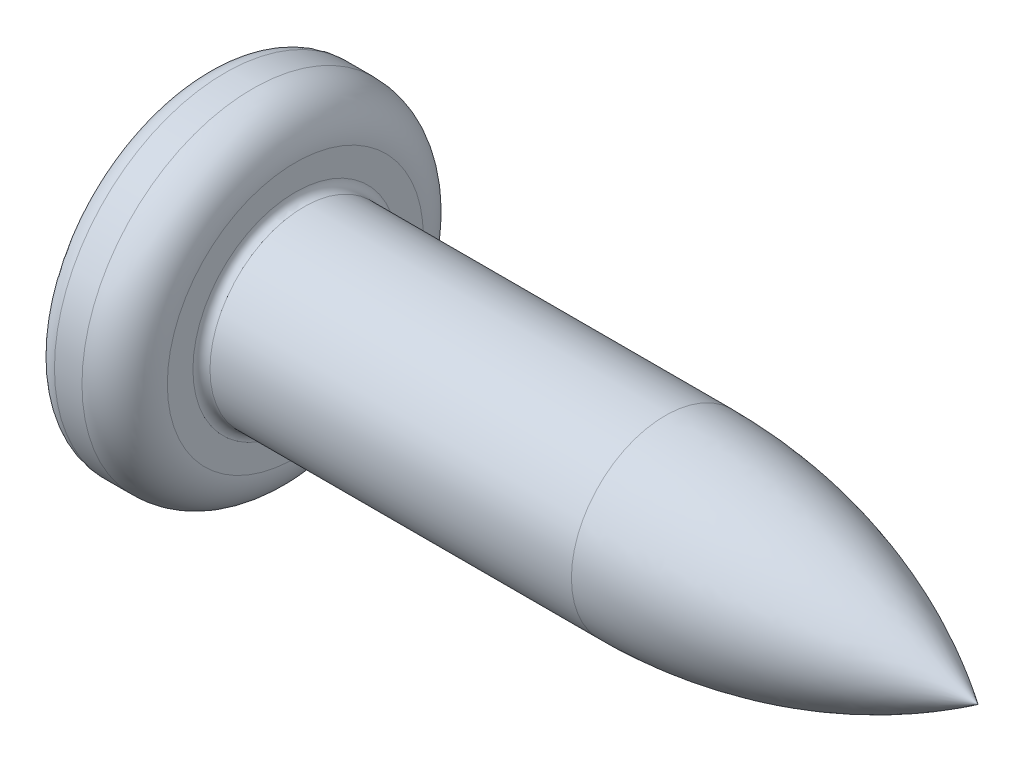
ISO-10303-21;
HEADER;
FILE_DESCRIPTION(('STEP AP214'),'2;1');
FILE_NAME('part.step','',(''),(''),'','','');
FILE_SCHEMA(('AUTOMOTIVE_DESIGN { 1 0 10303 214 1 1 1 1 }'));
ENDSEC;
DATA;
#1=APPLICATION_CONTEXT('core data for automotive mechanical design processes');
#2=APPLICATION_PROTOCOL_DEFINITION('international standard','automotive_design',2000,#1);
#3=PRODUCT_CONTEXT('',#1,'mechanical');
#4=PRODUCT('Part','Part','',(#3));
#5=PRODUCT_RELATED_PRODUCT_CATEGORY('part','',(#4));
#6=PRODUCT_DEFINITION_FORMATION('','',#4);
#7=PRODUCT_DEFINITION_CONTEXT('part definition',#1,'design');
#8=PRODUCT_DEFINITION('design','',#6,#7);
#9=PRODUCT_DEFINITION_SHAPE('','',#8);
#10=(LENGTH_UNIT() NAMED_UNIT(*) SI_UNIT(.MILLI.,.METRE.));
#11=(NAMED_UNIT(*) PLANE_ANGLE_UNIT() SI_UNIT($,.RADIAN.));
#12=(NAMED_UNIT(*) SI_UNIT($,.STERADIAN.) SOLID_ANGLE_UNIT());
#13=UNCERTAINTY_MEASURE_WITH_UNIT(LENGTH_MEASURE(1.E-05),#10,'distance_accuracy_value','');
#14=(GEOMETRIC_REPRESENTATION_CONTEXT(3) GLOBAL_UNCERTAINTY_ASSIGNED_CONTEXT((#13)) GLOBAL_UNIT_ASSIGNED_CONTEXT((#10,
#11,#12)) REPRESENTATION_CONTEXT('',''));
#15=CARTESIAN_POINT('',(0.,0.,0.));
#16=DIRECTION('',(0.,0.,1.));
#17=DIRECTION('',(1.,0.,0.));
#18=AXIS2_PLACEMENT_3D('',#15,#16,#17);
#19=CARTESIAN_POINT('',(4.,0.,0.));
#20=DIRECTION('',(-1.,0.,0.));
#21=DIRECTION('',(0.,1.,0.));
#22=AXIS2_PLACEMENT_3D('',#19,#20,#21);
#23=SPHERICAL_SURFACE('',#22,4.);
#24=CARTESIAN_POINT('',(0.465266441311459,0.,0.));
#25=DIRECTION('',(-1.,0.,0.));
#26=DIRECTION('',(0.,0.,1.));
#27=AXIS2_PLACEMENT_3D('',#24,#25,#26);
#28=CIRCLE('',#27,1.87234042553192);
#29=CARTESIAN_POINT('',(0.465266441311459,0.,1.87234042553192));
#30=VERTEX_POINT('',#29);
#31=EDGE_CURVE('E321',#30,#30,#28,.T.);
#32=ORIENTED_EDGE('',*,*,#31,.T.);
#33=EDGE_LOOP('',(#32));
#34=FACE_BOUND('',#33,.T.);
#35=CARTESIAN_POINT('',(0.0543400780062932,0.,0.));
#36=DIRECTION('',(1.,0.,0.));
#37=DIRECTION('',(0.,0.,-1.));
#38=AXIS2_PLACEMENT_3D('',#35,#36,#37);
#39=CIRCLE('',#38,0.657090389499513);
#40=CARTESIAN_POINT('',(0.0543400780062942,-0.369999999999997,-0.543017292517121));
#41=VERTEX_POINT('',#40);
#42=CARTESIAN_POINT('',(0.0543400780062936,-0.543017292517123,-0.37));
#43=VERTEX_POINT('',#42);
#44=EDGE_CURVE('E457',#41,#43,#39,.F.);
#45=ORIENTED_EDGE('',*,*,#44,.F.);
#46=CARTESIAN_POINT('',(4.,-0.37,0.));
#47=DIRECTION('',(0.,1.,0.));
#48=DIRECTION('',(0.,0.,1.));
#49=AXIS2_PLACEMENT_3D('',#46,#47,#48);
#50=CIRCLE('',#49,3.98285073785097);
#51=CARTESIAN_POINT('',(0.201999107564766,-0.369999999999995,-1.19928696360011));
#52=VERTEX_POINT('',#51);
#53=EDGE_CURVE('E283',#52,#41,#50,.T.);
#54=ORIENTED_EDGE('',*,*,#53,.F.);
#55=CARTESIAN_POINT('',(3.72274316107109,0.,0.556091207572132));
#56=DIRECTION('',(0.446197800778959,0.,-0.89493436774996));
#57=DIRECTION('',(-0.89493436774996,0.,-0.446197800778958));
#58=AXIS2_PLACEMENT_3D('',#55,#56,#57);
#59=CIRCLE('',#58,3.95144166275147);
#60=CARTESIAN_POINT('',(0.201999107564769,0.370000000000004,-1.19928696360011));
#61=VERTEX_POINT('',#60);
#62=EDGE_CURVE('E255',#52,#61,#59,.T.);
#63=ORIENTED_EDGE('',*,*,#62,.T.);
#64=CARTESIAN_POINT('',(4.,0.37,0.));
#65=DIRECTION('',(0.,-1.,0.));
#66=DIRECTION('',(0.,0.,-1.));
#67=AXIS2_PLACEMENT_3D('',#64,#65,#66);
#68=CIRCLE('',#67,3.98285073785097);
#69=CARTESIAN_POINT('',(0.0543400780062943,0.370000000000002,-0.543017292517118));
#70=VERTEX_POINT('',#69);
#71=EDGE_CURVE('E291',#70,#61,#68,.T.);
#72=ORIENTED_EDGE('',*,*,#71,.F.);
#73=CARTESIAN_POINT('',(0.0543400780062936,0.543017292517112,-0.37));
#74=VERTEX_POINT('',#73);
#75=EDGE_CURVE('E370',#74,#70,#39,.F.);
#76=ORIENTED_EDGE('',*,*,#75,.F.);
#77=CARTESIAN_POINT('',(4.,0.,-0.37));
#78=DIRECTION('',(0.,0.,1.));
#79=DIRECTION('',(0.,-1.,0.));
#80=AXIS2_PLACEMENT_3D('',#77,#78,#79);
#81=CIRCLE('',#80,3.98285073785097);
#82=CARTESIAN_POINT('',(0.201999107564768,1.19928696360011,-0.37));
#83=VERTEX_POINT('',#82);
#84=EDGE_CURVE('E249',#83,#74,#81,.T.);
#85=ORIENTED_EDGE('',*,*,#84,.F.);
#86=CARTESIAN_POINT('',(3.72274316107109,-0.556091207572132,0.));
#87=DIRECTION('',(0.446197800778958,0.89493436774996,0.));
#88=DIRECTION('',(-0.89493436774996,0.446197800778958,0.));
#89=AXIS2_PLACEMENT_3D('',#86,#87,#88);
#90=CIRCLE('',#89,3.95144166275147);
#91=CARTESIAN_POINT('',(0.201999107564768,1.19928696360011,0.369999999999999));
#92=VERTEX_POINT('',#91);
#93=EDGE_CURVE('E252',#83,#92,#90,.T.);
#94=ORIENTED_EDGE('',*,*,#93,.T.);
#95=CARTESIAN_POINT('',(4.,0.,0.37));
#96=DIRECTION('',(0.,0.,-1.));
#97=DIRECTION('',(0.,1.,0.));
#98=AXIS2_PLACEMENT_3D('',#95,#96,#97);
#99=CIRCLE('',#98,3.98285073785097);
#100=CARTESIAN_POINT('',(0.0543400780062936,0.543017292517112,0.37));
#101=VERTEX_POINT('',#100);
#102=EDGE_CURVE('E245',#101,#92,#99,.T.);
#103=ORIENTED_EDGE('',*,*,#102,.F.);
#104=CARTESIAN_POINT('',(0.054340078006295,0.369999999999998,0.54301729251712));
#105=VERTEX_POINT('',#104);
#106=EDGE_CURVE('E403',#105,#101,#39,.F.);
#107=ORIENTED_EDGE('',*,*,#106,.F.);
#108=CARTESIAN_POINT('',(0.201999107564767,0.369999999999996,1.19928696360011));
#109=VERTEX_POINT('',#108);
#110=EDGE_CURVE('E265',#109,#105,#68,.T.);
#111=ORIENTED_EDGE('',*,*,#110,.F.);
#112=CARTESIAN_POINT('',(3.72274316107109,0.,-0.556091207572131));
#113=DIRECTION('',(0.446197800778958,0.,0.89493436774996));
#114=DIRECTION('',(0.89493436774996,0.,-0.446197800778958));
#115=AXIS2_PLACEMENT_3D('',#112,#113,#114);
#116=CIRCLE('',#115,3.95144166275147);
#117=CARTESIAN_POINT('',(0.201999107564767,-0.370000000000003,1.19928696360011));
#118=VERTEX_POINT('',#117);
#119=EDGE_CURVE('E40',#109,#118,#116,.T.);
#120=ORIENTED_EDGE('',*,*,#119,.T.);
#121=CARTESIAN_POINT('',(0.0543400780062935,-0.370000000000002,0.543017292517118));
#122=VERTEX_POINT('',#121);
#123=EDGE_CURVE('E262',#122,#118,#50,.T.);
#124=ORIENTED_EDGE('',*,*,#123,.F.);
#125=CARTESIAN_POINT('',(0.0543400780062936,-0.543017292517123,0.369999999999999));
#126=VERTEX_POINT('',#125);
#127=EDGE_CURVE('E442',#126,#122,#39,.F.);
#128=ORIENTED_EDGE('',*,*,#127,.F.);
#129=CARTESIAN_POINT('',(0.201999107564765,-1.19928696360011,0.369999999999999));
#130=VERTEX_POINT('',#129);
#131=EDGE_CURVE('E246',#130,#126,#99,.T.);
#132=ORIENTED_EDGE('',*,*,#131,.F.);
#133=CARTESIAN_POINT('',(3.72274316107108,0.556091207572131,0.));
#134=DIRECTION('',(0.446197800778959,-0.89493436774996,0.));
#135=DIRECTION('',(0.89493436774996,0.446197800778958,0.));
#136=AXIS2_PLACEMENT_3D('',#133,#134,#135);
#137=CIRCLE('',#136,3.95144166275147);
#138=CARTESIAN_POINT('',(0.201999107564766,-1.19928696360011,-0.37));
#139=VERTEX_POINT('',#138);
#140=EDGE_CURVE('E242',#130,#139,#137,.T.);
#141=ORIENTED_EDGE('',*,*,#140,.T.);
#142=EDGE_CURVE('E55',#43,#139,#81,.T.);
#143=ORIENTED_EDGE('',*,*,#142,.F.);
#144=EDGE_LOOP('',(#45,#54,#63,#72,#76,#85,#94,#103,#107,#111,#120,#124,#128,#132,#141,#143));
#145=FACE_BOUND('',#144,.T.);
#146=ADVANCED_FACE('F27',(#34,#145),#23,.T.);
#147=CARTESIAN_POINT('',(1.5,0.552127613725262,-0.37));
#148=DIRECTION('',(0.,0.,1.));
#149=DIRECTION('',(0.,-1.,0.));
#150=AXIS2_PLACEMENT_3D('',#147,#148,#149);
#151=PLANE('',#150);
#152=ORIENTED_EDGE('',*,*,#84,.T.);
#153=CARTESIAN_POINT('',(-0.984107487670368,0.62894390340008,-0.37));
#154=CARTESIAN_POINT('',(-0.783603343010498,0.61266994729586,-0.37));
#155=CARTESIAN_POINT('',(-0.583110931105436,0.596248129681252,-0.37));
#156=CARTESIAN_POINT('',(-0.18215578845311,0.562989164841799,-0.37));
#157=CARTESIAN_POINT('',(0.0183069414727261,0.546152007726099,-0.37));
#158=CARTESIAN_POINT('',(0.419186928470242,0.511943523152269,-0.37));
#159=CARTESIAN_POINT('',(0.619604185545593,0.494572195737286,-0.37));
#160=CARTESIAN_POINT('',(1.02037173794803,0.459102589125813,-0.37));
#161=CARTESIAN_POINT('',(1.2207220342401,0.441004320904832,-0.37));
#162=CARTESIAN_POINT('',(1.53631168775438,0.411665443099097,-0.37));
#163=CARTESIAN_POINT('',(1.65158348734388,0.400774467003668,-0.37));
#164=CARTESIAN_POINT('',(1.88208360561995,0.378547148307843,-0.37));
#165=CARTESIAN_POINT('',(1.99731192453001,0.367210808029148,-0.37));
#166=CARTESIAN_POINT('',(2.22771614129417,0.343963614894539,-0.37));
#167=CARTESIAN_POINT('',(2.34289203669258,0.332052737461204,-0.37));
#168=CARTESIAN_POINT('',(2.57315819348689,0.307413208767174,-0.37));
#169=CARTESIAN_POINT('',(2.68824845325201,0.294684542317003,-0.37));
#170=CARTESIAN_POINT('',(2.80327961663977,0.281425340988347,-0.37));
#171=B_SPLINE_CURVE_WITH_KNOTS('',3,(#153,#154,#155,#156,#157,#158,#159,#160,#161,#162,#163,
#164,#165,#166,#167,#168,#169,#170),.UNSPECIFIED.,.F.,.F.,(4,2,2,2,2,2,2,2,4),(0.,
0.603490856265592,1.20699609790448,1.81050129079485,2.41399737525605,2.76135214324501,
3.1087051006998,3.45607293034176,3.80344721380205),.UNSPECIFIED.);
#172=CARTESIAN_POINT('',(1.5,0.415013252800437,-0.370000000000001));
#173=VERTEX_POINT('',#172);
#174=EDGE_CURVE('E363',#74,#173,#171,.T.);
#175=ORIENTED_EDGE('',*,*,#174,.T.);
#176=DIRECTION('',(0.,1.,0.));
#177=VECTOR('',#176,1.);
#178=CARTESIAN_POINT('',(1.5,-0.552127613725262,-0.37));
#179=LINE('',#178,#177);
#180=CARTESIAN_POINT('',(1.5,0.552127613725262,-0.37));
#181=VERTEX_POINT('',#180);
#182=EDGE_CURVE('E308',#173,#181,#179,.T.);
#183=ORIENTED_EDGE('',*,*,#182,.T.);
#184=DIRECTION('',(0.89493436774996,-0.446197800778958,0.));
#185=VECTOR('',#184,1.);
#186=CARTESIAN_POINT('',(0.,1.3,-0.37));
#187=LINE('',#186,#185);
#188=EDGE_CURVE('E314',#83,#181,#187,.T.);
#189=ORIENTED_EDGE('',*,*,#188,.F.);
#190=EDGE_LOOP('',(#152,#175,#183,#189));
#191=FACE_BOUND('',#190,.T.);
#192=ADVANCED_FACE('F188',(#191),#151,.T.);
#193=CARTESIAN_POINT('',(1.5,-0.552127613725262,-0.37));
#194=VERTEX_POINT('',#193);
#195=CARTESIAN_POINT('',(1.5,-0.415013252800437,-0.370000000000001));
#196=VERTEX_POINT('',#195);
#197=EDGE_CURVE('E305',#194,#196,#179,.T.);
#198=ORIENTED_EDGE('',*,*,#197,.T.);
#199=CARTESIAN_POINT('',(-0.984107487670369,-0.62894390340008,-0.37));
#200=CARTESIAN_POINT('',(-0.783603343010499,-0.61266994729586,-0.37));
#201=CARTESIAN_POINT('',(-0.583110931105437,-0.596248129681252,-0.37));
#202=CARTESIAN_POINT('',(-0.182155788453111,-0.562989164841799,-0.37));
#203=CARTESIAN_POINT('',(0.0183069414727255,-0.5461520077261,-0.37));
#204=CARTESIAN_POINT('',(0.419186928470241,-0.511943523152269,-0.37));
#205=CARTESIAN_POINT('',(0.619604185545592,-0.494572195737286,-0.37));
#206=CARTESIAN_POINT('',(1.02037173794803,-0.459102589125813,-0.37));
#207=CARTESIAN_POINT('',(1.22072203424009,-0.441004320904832,-0.37));
#208=CARTESIAN_POINT('',(1.53631168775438,-0.411665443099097,-0.37));
#209=CARTESIAN_POINT('',(1.65158348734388,-0.400774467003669,-0.37));
#210=CARTESIAN_POINT('',(1.88208360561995,-0.378547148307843,-0.37));
#211=CARTESIAN_POINT('',(1.99731192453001,-0.367210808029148,-0.37));
#212=CARTESIAN_POINT('',(2.22771614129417,-0.343963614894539,-0.37));
#213=CARTESIAN_POINT('',(2.34289203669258,-0.332052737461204,-0.37));
#214=CARTESIAN_POINT('',(2.57315819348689,-0.307413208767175,-0.37));
#215=CARTESIAN_POINT('',(2.68824845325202,-0.294684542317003,-0.37));
#216=CARTESIAN_POINT('',(2.80327961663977,-0.281425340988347,-0.37));
#217=B_SPLINE_CURVE_WITH_KNOTS('',3,(#199,#200,#201,#202,#203,#204,#205,#206,#207,#208,#209,
#210,#211,#212,#213,#214,#215,#216),.UNSPECIFIED.,.F.,.F.,(4,2,2,2,2,2,2,2,4),(0.,
0.603490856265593,1.20699609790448,1.81050129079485,2.41399737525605,2.76135214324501,
3.1087051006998,3.45607293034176,3.80344721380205),.UNSPECIFIED.);
#218=EDGE_CURVE('E356',#196,#43,#217,.F.);
#219=ORIENTED_EDGE('',*,*,#218,.T.);
#220=ORIENTED_EDGE('',*,*,#142,.T.);
#221=DIRECTION('',(0.89493436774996,0.446197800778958,0.));
#222=VECTOR('',#221,1.);
#223=CARTESIAN_POINT('',(0.,-1.3,-0.37));
#224=LINE('',#223,#222);
#225=EDGE_CURVE('E311',#139,#194,#224,.T.);
#226=ORIENTED_EDGE('',*,*,#225,.T.);
#227=EDGE_LOOP('',(#198,#219,#220,#226));
#228=FACE_BOUND('',#227,.T.);
#229=ADVANCED_FACE('F195',(#228),#151,.T.);
#230=CARTESIAN_POINT('',(1.5,-0.552127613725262,0.369999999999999));
#231=DIRECTION('',(0.,0.,-1.));
#232=DIRECTION('',(0.,1.,0.));
#233=AXIS2_PLACEMENT_3D('',#230,#231,#232);
#234=PLANE('',#233);
#235=DIRECTION('',(0.,-1.,0.));
#236=VECTOR('',#235,1.);
#237=CARTESIAN_POINT('',(1.5,0.552127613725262,0.37));
#238=LINE('',#237,#236);
#239=CARTESIAN_POINT('',(1.5,0.552127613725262,0.37));
#240=VERTEX_POINT('',#239);
#241=CARTESIAN_POINT('',(1.5,0.415013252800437,0.370000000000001));
#242=VERTEX_POINT('',#241);
#243=EDGE_CURVE('E297',#240,#242,#238,.T.);
#244=ORIENTED_EDGE('',*,*,#243,.T.);
#245=CARTESIAN_POINT('',(-0.984107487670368,0.62894390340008,0.37));
#246=CARTESIAN_POINT('',(-0.783603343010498,0.61266994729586,0.37));
#247=CARTESIAN_POINT('',(-0.583110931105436,0.596248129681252,0.37));
#248=CARTESIAN_POINT('',(-0.18215578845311,0.562989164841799,0.37));
#249=CARTESIAN_POINT('',(0.0183069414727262,0.5461520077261,0.37));
#250=CARTESIAN_POINT('',(0.419186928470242,0.511943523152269,0.37));
#251=CARTESIAN_POINT('',(0.619604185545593,0.494572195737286,0.37));
#252=CARTESIAN_POINT('',(1.02037173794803,0.459102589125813,0.37));
#253=CARTESIAN_POINT('',(1.22072203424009,0.441004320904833,0.37));
#254=CARTESIAN_POINT('',(1.53631168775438,0.411665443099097,0.37));
#255=CARTESIAN_POINT('',(1.65158348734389,0.400774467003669,0.37));
#256=CARTESIAN_POINT('',(1.88208360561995,0.378547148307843,0.37));
#257=CARTESIAN_POINT('',(1.99731192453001,0.367210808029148,0.37));
#258=CARTESIAN_POINT('',(2.22771614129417,0.343963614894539,0.37));
#259=CARTESIAN_POINT('',(2.34289203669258,0.332052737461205,0.37));
#260=CARTESIAN_POINT('',(2.57315819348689,0.307413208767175,0.37));
#261=CARTESIAN_POINT('',(2.68824845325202,0.294684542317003,0.37));
#262=CARTESIAN_POINT('',(2.80327961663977,0.281425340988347,0.37));
#263=B_SPLINE_CURVE_WITH_KNOTS('',3,(#245,#246,#247,#248,#249,#250,#251,#252,#253,#254,#255,
#256,#257,#258,#259,#260,#261,#262),.UNSPECIFIED.,.F.,.F.,(4,2,2,2,2,2,2,2,4),(0.,
0.603490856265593,1.20699609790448,1.81050129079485,2.41399737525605,2.76135214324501,
3.1087051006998,3.45607293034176,3.80344721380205),.UNSPECIFIED.);
#264=EDGE_CURVE('E404',#242,#101,#263,.F.);
#265=ORIENTED_EDGE('',*,*,#264,.T.);
#266=ORIENTED_EDGE('',*,*,#102,.T.);
#267=DIRECTION('',(0.89493436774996,-0.446197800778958,0.));
#268=VECTOR('',#267,1.);
#269=CARTESIAN_POINT('',(0.,1.3,0.37));
#270=LINE('',#269,#268);
#271=EDGE_CURVE('E313',#92,#240,#270,.T.);
#272=ORIENTED_EDGE('',*,*,#271,.T.);
#273=EDGE_LOOP('',(#244,#265,#266,#272));
#274=FACE_BOUND('',#273,.T.);
#275=ADVANCED_FACE('F351',(#274),#234,.T.);
#276=ORIENTED_EDGE('',*,*,#131,.T.);
#277=CARTESIAN_POINT('',(-0.984107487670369,-0.62894390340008,0.369999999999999));
#278=CARTESIAN_POINT('',(-0.783603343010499,-0.612669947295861,0.369999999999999));
#279=CARTESIAN_POINT('',(-0.583110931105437,-0.596248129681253,0.369999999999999));
#280=CARTESIAN_POINT('',(-0.18215578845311,-0.5629891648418,0.369999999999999));
#281=CARTESIAN_POINT('',(0.0183069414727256,-0.5461520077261,0.369999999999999));
#282=CARTESIAN_POINT('',(0.419186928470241,-0.511943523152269,0.369999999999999));
#283=CARTESIAN_POINT('',(0.619604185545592,-0.494572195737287,0.369999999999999));
#284=CARTESIAN_POINT('',(1.02037173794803,-0.459102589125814,0.369999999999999));
#285=CARTESIAN_POINT('',(1.22072203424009,-0.441004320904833,0.369999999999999));
#286=CARTESIAN_POINT('',(1.53631168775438,-0.411665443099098,0.369999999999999));
#287=CARTESIAN_POINT('',(1.65158348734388,-0.400774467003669,0.37));
#288=CARTESIAN_POINT('',(1.88208360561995,-0.378547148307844,0.37));
#289=CARTESIAN_POINT('',(1.99731192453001,-0.367210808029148,0.37));
#290=CARTESIAN_POINT('',(2.22771614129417,-0.34396361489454,0.37));
#291=CARTESIAN_POINT('',(2.34289203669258,-0.332052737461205,0.37));
#292=CARTESIAN_POINT('',(2.57315819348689,-0.307413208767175,0.37));
#293=CARTESIAN_POINT('',(2.68824845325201,-0.294684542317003,0.37));
#294=CARTESIAN_POINT('',(2.80327961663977,-0.281425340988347,0.37));
#295=B_SPLINE_CURVE_WITH_KNOTS('',3,(#277,#278,#279,#280,#281,#282,#283,#284,#285,#286,#287,
#288,#289,#290,#291,#292,#293,#294),.UNSPECIFIED.,.F.,.F.,(4,2,2,2,2,2,2,2,4),(0.,
0.603490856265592,1.20699609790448,1.81050129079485,2.41399737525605,2.76135214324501,
3.1087051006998,3.45607293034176,3.80344721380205),.UNSPECIFIED.);
#296=CARTESIAN_POINT('',(1.5,-0.415013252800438,0.37));
#297=VERTEX_POINT('',#296);
#298=EDGE_CURVE('E394',#126,#297,#295,.T.);
#299=ORIENTED_EDGE('',*,*,#298,.T.);
#300=CARTESIAN_POINT('',(1.5,-0.552127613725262,0.369999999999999));
#301=VERTEX_POINT('',#300);
#302=EDGE_CURVE('E300',#297,#301,#238,.T.);
#303=ORIENTED_EDGE('',*,*,#302,.T.);
#304=DIRECTION('',(0.89493436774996,0.446197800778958,0.));
#305=VECTOR('',#304,1.);
#306=CARTESIAN_POINT('',(0.,-1.3,0.369999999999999));
#307=LINE('',#306,#305);
#308=EDGE_CURVE('E295',#130,#301,#307,.T.);
#309=ORIENTED_EDGE('',*,*,#308,.F.);
#310=EDGE_LOOP('',(#276,#299,#303,#309));
#311=FACE_BOUND('',#310,.T.);
#312=ADVANCED_FACE('F347',(#311),#234,.T.);
#313=CARTESIAN_POINT('',(1.5,0.552127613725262,0.37));
#314=DIRECTION('',(0.446197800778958,0.89493436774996,0.));
#315=DIRECTION('',(-0.89493436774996,0.446197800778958,0.));
#316=AXIS2_PLACEMENT_3D('',#313,#314,#315);
#317=PLANE('',#316);
#318=CARTESIAN_POINT('',(2.47007520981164,0.0684659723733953,0.));
#319=DIRECTION('',(0.446197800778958,0.89493436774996,0.));
#320=DIRECTION('',(-0.89493436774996,0.446197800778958,0.));
#321=AXIS2_PLACEMENT_3D('',#318,#319,#320);
#322=ELLIPSE('',#321,1.09405678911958,0.483340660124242);
#323=CARTESIAN_POINT('',(1.5,0.552127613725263,0.0655064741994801));
#324=VERTEX_POINT('',#323);
#325=CARTESIAN_POINT('',(1.5,0.552127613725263,-0.0655064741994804));
#326=VERTEX_POINT('',#325);
#327=EDGE_CURVE('E434',#324,#326,#322,.F.);
#328=ORIENTED_EDGE('',*,*,#327,.F.);
#329=DIRECTION('',(0.,0.,-1.));
#330=VECTOR('',#329,1.);
#331=CARTESIAN_POINT('',(1.5,0.552127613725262,0.37));
#332=LINE('',#331,#330);
#333=EDGE_CURVE('E301',#240,#324,#332,.T.);
#334=ORIENTED_EDGE('',*,*,#333,.F.);
#335=ORIENTED_EDGE('',*,*,#271,.F.);
#336=ORIENTED_EDGE('',*,*,#93,.F.);
#337=ORIENTED_EDGE('',*,*,#188,.T.);
#338=EDGE_CURVE('E304',#326,#181,#332,.T.);
#339=ORIENTED_EDGE('',*,*,#338,.F.);
#340=EDGE_LOOP('',(#328,#334,#335,#336,#337,#339));
#341=FACE_BOUND('',#340,.T.);
#342=ADVANCED_FACE('F344',(#341),#317,.F.);
#343=CARTESIAN_POINT('',(0.,-1.3,-0.37));
#344=DIRECTION('',(0.446197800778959,-0.89493436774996,0.));
#345=DIRECTION('',(0.89493436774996,0.446197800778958,0.));
#346=AXIS2_PLACEMENT_3D('',#343,#344,#345);
#347=PLANE('',#346);
#348=CARTESIAN_POINT('',(2.47007520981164,-0.0684659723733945,0.));
#349=DIRECTION('',(0.446197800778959,-0.89493436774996,0.));
#350=DIRECTION('',(-0.89493436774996,-0.446197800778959,0.));
#351=AXIS2_PLACEMENT_3D('',#348,#349,#350);
#352=ELLIPSE('',#351,1.09405678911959,0.483340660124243);
#353=CARTESIAN_POINT('',(1.5,-0.552127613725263,-0.0655064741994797));
#354=VERTEX_POINT('',#353);
#355=CARTESIAN_POINT('',(1.5,-0.552127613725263,0.0655064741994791));
#356=VERTEX_POINT('',#355);
#357=EDGE_CURVE('E430',#354,#356,#352,.F.);
#358=ORIENTED_EDGE('',*,*,#357,.F.);
#359=DIRECTION('',(0.,0.,1.));
#360=VECTOR('',#359,1.);
#361=CARTESIAN_POINT('',(1.5,-0.552127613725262,-0.37));
#362=LINE('',#361,#360);
#363=EDGE_CURVE('E292',#194,#354,#362,.T.);
#364=ORIENTED_EDGE('',*,*,#363,.F.);
#365=ORIENTED_EDGE('',*,*,#225,.F.);
#366=ORIENTED_EDGE('',*,*,#140,.F.);
#367=ORIENTED_EDGE('',*,*,#308,.T.);
#368=EDGE_CURVE('E296',#356,#301,#362,.T.);
#369=ORIENTED_EDGE('',*,*,#368,.F.);
#370=EDGE_LOOP('',(#358,#364,#365,#366,#367,#369));
#371=FACE_BOUND('',#370,.T.);
#372=ADVANCED_FACE('F346',(#371),#347,.F.);
#373=CARTESIAN_POINT('',(1.5,0.552127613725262,-0.37));
#374=DIRECTION('',(-1.,0.,0.));
#375=DIRECTION('',(0.,0.,1.));
#376=AXIS2_PLACEMENT_3D('',#373,#374,#375);
#377=PLANE('',#376);
#378=DIRECTION('',(0.,1.,0.));
#379=VECTOR('',#378,1.);
#380=CARTESIAN_POINT('',(1.5,-0.370000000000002,0.55212761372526));
#381=LINE('',#380,#379);
#382=CARTESIAN_POINT('',(1.5,-0.370000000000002,0.55212761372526));
#383=VERTEX_POINT('',#382);
#384=CARTESIAN_POINT('',(1.5,-0.0655064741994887,0.552127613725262));
#385=VERTEX_POINT('',#384);
#386=EDGE_CURVE('E498',#383,#385,#381,.T.);
#387=ORIENTED_EDGE('',*,*,#386,.T.);
#388=CARTESIAN_POINT('',(1.5,0.,0.));
#389=DIRECTION('',(-1.,0.,0.));
#390=DIRECTION('',(0.,0.,1.));
#391=AXIS2_PLACEMENT_3D('',#388,#389,#390);
#392=CIRCLE('',#391,0.556);
#393=CARTESIAN_POINT('',(1.5,-0.370000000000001,0.415013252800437));
#394=VERTEX_POINT('',#393);
#395=EDGE_CURVE('E455',#394,#385,#392,.T.);
#396=ORIENTED_EDGE('',*,*,#395,.F.);
#397=DIRECTION('',(0.,0.,-1.));
#398=VECTOR('',#397,1.);
#399=CARTESIAN_POINT('',(1.5,-0.370000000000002,0.55212761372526));
#400=LINE('',#399,#398);
#401=EDGE_CURVE('E493',#383,#394,#400,.T.);
#402=ORIENTED_EDGE('',*,*,#401,.F.);
#403=EDGE_LOOP('',(#387,#396,#402));
#404=FACE_BOUND('',#403,.T.);
#405=ADVANCED_FACE('F419',(#404),#377,.T.);
#406=ORIENTED_EDGE('',*,*,#302,.F.);
#407=EDGE_CURVE('E450',#356,#297,#392,.T.);
#408=ORIENTED_EDGE('',*,*,#407,.F.);
#409=ORIENTED_EDGE('',*,*,#368,.T.);
#410=EDGE_LOOP('',(#406,#408,#409));
#411=FACE_BOUND('',#410,.T.);
#412=ADVANCED_FACE('F421',(#411),#377,.T.);
#413=ORIENTED_EDGE('',*,*,#363,.T.);
#414=EDGE_CURVE('E439',#196,#354,#392,.T.);
#415=ORIENTED_EDGE('',*,*,#414,.F.);
#416=ORIENTED_EDGE('',*,*,#197,.F.);
#417=EDGE_LOOP('',(#413,#415,#416));
#418=FACE_BOUND('',#417,.T.);
#419=ADVANCED_FACE('F437',(#418),#377,.T.);
#420=CARTESIAN_POINT('',(1.5,-0.369999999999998,-0.415013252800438));
#421=VERTEX_POINT('',#420);
#422=CARTESIAN_POINT('',(1.5,-0.369999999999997,-0.552127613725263));
#423=VERTEX_POINT('',#422);
#424=EDGE_CURVE('E487',#421,#423,#400,.T.);
#425=ORIENTED_EDGE('',*,*,#424,.F.);
#426=CARTESIAN_POINT('',(1.5,-0.0655064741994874,-0.552127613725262));
#427=VERTEX_POINT('',#426);
#428=EDGE_CURVE('E47',#427,#421,#392,.T.);
#429=ORIENTED_EDGE('',*,*,#428,.F.);
#430=DIRECTION('',(0.,-1.,0.));
#431=VECTOR('',#430,1.);
#432=CARTESIAN_POINT('',(1.5,0.370000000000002,-0.55212761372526));
#433=LINE('',#432,#431);
#434=EDGE_CURVE('E485',#427,#423,#433,.T.);
#435=ORIENTED_EDGE('',*,*,#434,.T.);
#436=EDGE_LOOP('',(#425,#429,#435));
#437=FACE_BOUND('',#436,.T.);
#438=ADVANCED_FACE('F484',(#437),#377,.T.);
#439=CARTESIAN_POINT('',(1.5,0.370000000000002,-0.55212761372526));
#440=VERTEX_POINT('',#439);
#441=CARTESIAN_POINT('',(1.5,0.0655064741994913,-0.552127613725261));
#442=VERTEX_POINT('',#441);
#443=EDGE_CURVE('E492',#440,#442,#433,.T.);
#444=ORIENTED_EDGE('',*,*,#443,.T.);
#445=CARTESIAN_POINT('',(1.5,0.370000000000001,-0.415013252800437));
#446=VERTEX_POINT('',#445);
#447=EDGE_CURVE('E481',#446,#442,#392,.T.);
#448=ORIENTED_EDGE('',*,*,#447,.F.);
#449=DIRECTION('',(0.,0.,1.));
#450=VECTOR('',#449,1.);
#451=CARTESIAN_POINT('',(1.5,0.370000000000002,-0.55212761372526));
#452=LINE('',#451,#450);
#453=EDGE_CURVE('E502',#440,#446,#452,.T.);
#454=ORIENTED_EDGE('',*,*,#453,.F.);
#455=EDGE_LOOP('',(#444,#448,#454));
#456=FACE_BOUND('',#455,.T.);
#457=ADVANCED_FACE('F509',(#456),#377,.T.);
#458=ORIENTED_EDGE('',*,*,#182,.F.);
#459=EDGE_CURVE('E511',#326,#173,#392,.T.);
#460=ORIENTED_EDGE('',*,*,#459,.F.);
#461=ORIENTED_EDGE('',*,*,#338,.T.);
#462=EDGE_LOOP('',(#458,#460,#461));
#463=FACE_BOUND('',#462,.T.);
#464=ADVANCED_FACE('F537',(#463),#377,.T.);
#465=ORIENTED_EDGE('',*,*,#333,.T.);
#466=EDGE_CURVE('E516',#242,#324,#392,.T.);
#467=ORIENTED_EDGE('',*,*,#466,.F.);
#468=ORIENTED_EDGE('',*,*,#243,.F.);
#469=EDGE_LOOP('',(#465,#467,#468));
#470=FACE_BOUND('',#469,.T.);
#471=ADVANCED_FACE('F525',(#470),#377,.T.);
#472=CARTESIAN_POINT('',(1.5,0.369999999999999,0.415013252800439));
#473=VERTEX_POINT('',#472);
#474=CARTESIAN_POINT('',(1.5,0.369999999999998,0.552127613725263));
#475=VERTEX_POINT('',#474);
#476=EDGE_CURVE('E280',#473,#475,#452,.T.);
#477=ORIENTED_EDGE('',*,*,#476,.F.);
#478=CARTESIAN_POINT('',(1.5,0.0655064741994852,0.552127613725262));
#479=VERTEX_POINT('',#478);
#480=EDGE_CURVE('E456',#479,#473,#392,.T.);
#481=ORIENTED_EDGE('',*,*,#480,.F.);
#482=EDGE_CURVE('E501',#479,#475,#381,.T.);
#483=ORIENTED_EDGE('',*,*,#482,.T.);
#484=EDGE_LOOP('',(#477,#481,#483));
#485=FACE_BOUND('',#484,.T.);
#486=ADVANCED_FACE('F413',(#485),#377,.T.);
#487=CARTESIAN_POINT('',(1.5,0.369999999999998,0.552127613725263));
#488=DIRECTION('',(0.,-1.,0.));
#489=DIRECTION('',(0.,0.,-1.));
#490=AXIS2_PLACEMENT_3D('',#487,#488,#489);
#491=PLANE('',#490);
#492=ORIENTED_EDGE('',*,*,#110,.T.);
#493=CARTESIAN_POINT('',(-0.98410748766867,0.369999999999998,0.628943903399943));
#494=CARTESIAN_POINT('',(-0.783603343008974,0.369999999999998,0.612669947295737));
#495=CARTESIAN_POINT('',(-0.583110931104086,0.369999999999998,0.596248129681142));
#496=CARTESIAN_POINT('',(-0.182155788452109,0.369999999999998,0.562989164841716));
#497=CARTESIAN_POINT('',(0.0183069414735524,0.369999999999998,0.546152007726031));
#498=CARTESIAN_POINT('',(0.419186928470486,0.369999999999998,0.511943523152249));
#499=CARTESIAN_POINT('',(0.619604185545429,0.369999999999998,0.494572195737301));
#500=CARTESIAN_POINT('',(1.02037173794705,0.369999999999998,0.459102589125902));
#501=CARTESIAN_POINT('',(1.22072203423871,0.369999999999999,0.44100432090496));
#502=CARTESIAN_POINT('',(1.53631168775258,0.369999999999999,0.411665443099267));
#503=CARTESIAN_POINT('',(1.65158348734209,0.369999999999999,0.40077446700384));
#504=CARTESIAN_POINT('',(1.88208360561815,0.369999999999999,0.378547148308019));
#505=CARTESIAN_POINT('',(1.99731192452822,0.369999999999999,0.367210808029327));
#506=CARTESIAN_POINT('',(2.22771614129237,0.369999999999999,0.343963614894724));
#507=CARTESIAN_POINT('',(2.34289203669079,0.369999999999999,0.332052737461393));
#508=CARTESIAN_POINT('',(2.5731581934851,0.369999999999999,0.307413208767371));
#509=CARTESIAN_POINT('',(2.68824845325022,0.369999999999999,0.294684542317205));
#510=CARTESIAN_POINT('',(2.80327961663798,0.369999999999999,0.281425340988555));
#511=B_SPLINE_CURVE_WITH_KNOTS('',3,(#493,#494,#495,#496,#497,#498,#499,#500,#501,#502,#503,
#504,#505,#506,#507,#508,#509,#510),.UNSPECIFIED.,.F.,.F.,(4,2,2,2,2,2,2,2,4),(0.,
0.603490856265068,1.20699609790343,1.81050129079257,2.41399737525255,2.7613521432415,
3.1087051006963,3.45607293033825,3.80344721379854),.UNSPECIFIED.);
#512=EDGE_CURVE('E399',#105,#473,#511,.T.);
#513=ORIENTED_EDGE('',*,*,#512,.T.);
#514=ORIENTED_EDGE('',*,*,#476,.T.);
#515=DIRECTION('',(0.89493436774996,0.,-0.446197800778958));
#516=VECTOR('',#515,1.);
#517=CARTESIAN_POINT('',(0.,0.369999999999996,1.3));
#518=LINE('',#517,#516);
#519=EDGE_CURVE('E273',#109,#475,#518,.T.);
#520=ORIENTED_EDGE('',*,*,#519,.F.);
#521=EDGE_LOOP('',(#492,#513,#514,#520));
#522=FACE_BOUND('',#521,.T.);
#523=ADVANCED_FACE('F277',(#522),#491,.T.);
#524=CARTESIAN_POINT('',(1.5,-0.369999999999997,-0.552127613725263));
#525=DIRECTION('',(0.,1.,0.));
#526=DIRECTION('',(0.,0.,1.));
#527=AXIS2_PLACEMENT_3D('',#524,#525,#526);
#528=PLANE('',#527);
#529=ORIENTED_EDGE('',*,*,#401,.T.);
#530=CARTESIAN_POINT('',(-0.984107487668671,-0.370000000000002,0.628943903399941));
#531=CARTESIAN_POINT('',(-0.783603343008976,-0.370000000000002,0.612669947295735));
#532=CARTESIAN_POINT('',(-0.583110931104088,-0.370000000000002,0.59624812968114));
#533=CARTESIAN_POINT('',(-0.18215578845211,-0.370000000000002,0.562989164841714));
#534=CARTESIAN_POINT('',(0.0183069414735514,-0.370000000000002,0.546152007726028));
#535=CARTESIAN_POINT('',(0.419186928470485,-0.370000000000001,0.511943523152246));
#536=CARTESIAN_POINT('',(0.619604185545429,-0.370000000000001,0.494572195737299));
#537=CARTESIAN_POINT('',(1.02037173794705,-0.370000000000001,0.4591025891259));
#538=CARTESIAN_POINT('',(1.22072203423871,-0.370000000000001,0.441004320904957));
#539=CARTESIAN_POINT('',(1.53631168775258,-0.370000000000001,0.411665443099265));
#540=CARTESIAN_POINT('',(1.65158348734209,-0.370000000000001,0.400774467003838));
#541=CARTESIAN_POINT('',(1.88208360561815,-0.370000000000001,0.378547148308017));
#542=CARTESIAN_POINT('',(1.99731192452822,-0.370000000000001,0.367210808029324));
#543=CARTESIAN_POINT('',(2.22771614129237,-0.370000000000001,0.343963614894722));
#544=CARTESIAN_POINT('',(2.34289203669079,-0.370000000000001,0.332052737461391));
#545=CARTESIAN_POINT('',(2.5731581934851,-0.370000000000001,0.307413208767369));
#546=CARTESIAN_POINT('',(2.68824845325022,-0.370000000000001,0.294684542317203));
#547=CARTESIAN_POINT('',(2.80327961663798,-0.370000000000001,0.281425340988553));
#548=B_SPLINE_CURVE_WITH_KNOTS('',3,(#530,#531,#532,#533,#534,#535,#536,#537,#538,#539,#540,
#541,#542,#543,#544,#545,#546,#547),.UNSPECIFIED.,.F.,.F.,(4,2,2,2,2,2,2,2,4),(0.,
0.603490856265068,1.20699609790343,1.81050129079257,2.41399737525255,2.7613521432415,
3.1087051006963,3.45607293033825,3.80344721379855),.UNSPECIFIED.);
#549=EDGE_CURVE('E389',#394,#122,#548,.F.);
#550=ORIENTED_EDGE('',*,*,#549,.T.);
#551=ORIENTED_EDGE('',*,*,#123,.T.);
#552=DIRECTION('',(0.89493436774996,0.,-0.446197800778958));
#553=VECTOR('',#552,1.);
#554=CARTESIAN_POINT('',(0.,-0.370000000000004,1.3));
#555=LINE('',#554,#553);
#556=EDGE_CURVE('E275',#118,#383,#555,.T.);
#557=ORIENTED_EDGE('',*,*,#556,.T.);
#558=EDGE_LOOP('',(#529,#550,#551,#557));
#559=FACE_BOUND('',#558,.T.);
#560=ADVANCED_FACE('F412',(#559),#528,.T.);
#561=CARTESIAN_POINT('',(1.5,-0.370000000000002,0.55212761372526));
#562=DIRECTION('',(0.446197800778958,0.,0.89493436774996));
#563=DIRECTION('',(-0.89493436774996,0.,0.446197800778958));
#564=AXIS2_PLACEMENT_3D('',#561,#562,#563);
#565=PLANE('',#564);
#566=CARTESIAN_POINT('',(2.47007520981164,0.,0.0684659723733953));
#567=DIRECTION('',(0.446197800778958,0.,0.89493436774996));
#568=DIRECTION('',(-0.89493436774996,0.,0.446197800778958));
#569=AXIS2_PLACEMENT_3D('',#566,#567,#568);
#570=ELLIPSE('',#569,1.09405678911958,0.483340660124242);
#571=EDGE_CURVE('E465',#385,#479,#570,.F.);
#572=ORIENTED_EDGE('',*,*,#571,.F.);
#573=ORIENTED_EDGE('',*,*,#386,.F.);
#574=ORIENTED_EDGE('',*,*,#556,.F.);
#575=ORIENTED_EDGE('',*,*,#119,.F.);
#576=ORIENTED_EDGE('',*,*,#519,.T.);
#577=ORIENTED_EDGE('',*,*,#482,.F.);
#578=EDGE_LOOP('',(#572,#573,#574,#575,#576,#577));
#579=FACE_BOUND('',#578,.T.);
#580=ADVANCED_FACE('F271',(#579),#565,.F.);
#581=CARTESIAN_POINT('',(0.,0.370000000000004,-1.3));
#582=DIRECTION('',(0.446197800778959,0.,-0.89493436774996));
#583=DIRECTION('',(0.89493436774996,0.,0.446197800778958));
#584=AXIS2_PLACEMENT_3D('',#581,#582,#583);
#585=PLANE('',#584);
#586=CARTESIAN_POINT('',(2.47007520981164,0.,-0.0684659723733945));
#587=DIRECTION('',(0.446197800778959,0.,-0.89493436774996));
#588=DIRECTION('',(-0.89493436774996,0.,-0.446197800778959));
#589=AXIS2_PLACEMENT_3D('',#586,#587,#588);
#590=ELLIPSE('',#589,1.09405678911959,0.483340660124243);
#591=EDGE_CURVE('E369',#442,#427,#590,.F.);
#592=ORIENTED_EDGE('',*,*,#591,.F.);
#593=ORIENTED_EDGE('',*,*,#443,.F.);
#594=DIRECTION('',(0.89493436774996,0.,0.446197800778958));
#595=VECTOR('',#594,1.);
#596=CARTESIAN_POINT('',(0.,0.370000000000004,-1.3));
#597=LINE('',#596,#595);
#598=EDGE_CURVE('E285',#61,#440,#597,.T.);
#599=ORIENTED_EDGE('',*,*,#598,.F.);
#600=ORIENTED_EDGE('',*,*,#62,.F.);
#601=DIRECTION('',(0.89493436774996,0.,0.446197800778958));
#602=VECTOR('',#601,1.);
#603=CARTESIAN_POINT('',(0.,-0.369999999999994,-1.3));
#604=LINE('',#603,#602);
#605=EDGE_CURVE('E491',#52,#423,#604,.T.);
#606=ORIENTED_EDGE('',*,*,#605,.T.);
#607=ORIENTED_EDGE('',*,*,#434,.F.);
#608=EDGE_LOOP('',(#592,#593,#599,#600,#606,#607));
#609=FACE_BOUND('',#608,.T.);
#610=ADVANCED_FACE('F379',(#609),#585,.F.);
#611=ORIENTED_EDGE('',*,*,#453,.T.);
#612=CARTESIAN_POINT('',(-0.984107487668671,0.370000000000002,-0.628943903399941));
#613=CARTESIAN_POINT('',(-0.783603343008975,0.370000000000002,-0.612669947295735));
#614=CARTESIAN_POINT('',(-0.583110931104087,0.370000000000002,-0.59624812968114));
#615=CARTESIAN_POINT('',(-0.18215578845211,0.370000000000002,-0.562989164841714));
#616=CARTESIAN_POINT('',(0.0183069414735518,0.370000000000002,-0.546152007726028));
#617=CARTESIAN_POINT('',(0.419186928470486,0.370000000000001,-0.511943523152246));
#618=CARTESIAN_POINT('',(0.619604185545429,0.370000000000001,-0.494572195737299));
#619=CARTESIAN_POINT('',(1.02037173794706,0.370000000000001,-0.459102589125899));
#620=CARTESIAN_POINT('',(1.22072203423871,0.370000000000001,-0.441004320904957));
#621=CARTESIAN_POINT('',(1.53631168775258,0.370000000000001,-0.411665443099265));
#622=CARTESIAN_POINT('',(1.65158348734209,0.370000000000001,-0.400774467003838));
#623=CARTESIAN_POINT('',(1.88208360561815,0.370000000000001,-0.378547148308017));
#624=CARTESIAN_POINT('',(1.99731192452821,0.370000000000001,-0.367210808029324));
#625=CARTESIAN_POINT('',(2.22771614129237,0.370000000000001,-0.343963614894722));
#626=CARTESIAN_POINT('',(2.34289203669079,0.370000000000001,-0.332052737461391));
#627=CARTESIAN_POINT('',(2.5731581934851,0.370000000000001,-0.307413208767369));
#628=CARTESIAN_POINT('',(2.68824845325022,0.370000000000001,-0.294684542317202));
#629=CARTESIAN_POINT('',(2.80327961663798,0.370000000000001,-0.281425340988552));
#630=B_SPLINE_CURVE_WITH_KNOTS('',3,(#612,#613,#614,#615,#616,#617,#618,#619,#620,#621,#622,
#623,#624,#625,#626,#627,#628,#629),.UNSPECIFIED.,.F.,.F.,(4,2,2,2,2,2,2,2,4),(0.,
0.603490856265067,1.20699609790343,1.81050129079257,2.41399737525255,2.7613521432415,
3.1087051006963,3.45607293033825,3.80344721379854),.UNSPECIFIED.);
#631=EDGE_CURVE('E371',#446,#70,#630,.F.);
#632=ORIENTED_EDGE('',*,*,#631,.T.);
#633=ORIENTED_EDGE('',*,*,#71,.T.);
#634=ORIENTED_EDGE('',*,*,#598,.T.);
#635=EDGE_LOOP('',(#611,#632,#633,#634));
#636=FACE_BOUND('',#635,.T.);
#637=ADVANCED_FACE('F414',(#636),#491,.T.);
#638=ORIENTED_EDGE('',*,*,#53,.T.);
#639=CARTESIAN_POINT('',(-0.984107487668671,-0.369999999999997,-0.628943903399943));
#640=CARTESIAN_POINT('',(-0.783603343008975,-0.369999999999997,-0.612669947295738));
#641=CARTESIAN_POINT('',(-0.583110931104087,-0.369999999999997,-0.596248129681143));
#642=CARTESIAN_POINT('',(-0.18215578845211,-0.369999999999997,-0.562989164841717));
#643=CARTESIAN_POINT('',(0.0183069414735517,-0.369999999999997,-0.546152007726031));
#644=CARTESIAN_POINT('',(0.419186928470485,-0.369999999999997,-0.511943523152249));
#645=CARTESIAN_POINT('',(0.619604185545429,-0.369999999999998,-0.494572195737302));
#646=CARTESIAN_POINT('',(1.02037173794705,-0.369999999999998,-0.459102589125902));
#647=CARTESIAN_POINT('',(1.22072203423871,-0.369999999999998,-0.44100432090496));
#648=CARTESIAN_POINT('',(1.53631168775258,-0.369999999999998,-0.411665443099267));
#649=CARTESIAN_POINT('',(1.65158348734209,-0.369999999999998,-0.400774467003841));
#650=CARTESIAN_POINT('',(1.88208360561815,-0.369999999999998,-0.37854714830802));
#651=CARTESIAN_POINT('',(1.99731192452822,-0.369999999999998,-0.367210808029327));
#652=CARTESIAN_POINT('',(2.22771614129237,-0.369999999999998,-0.343963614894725));
#653=CARTESIAN_POINT('',(2.34289203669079,-0.369999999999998,-0.332052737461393));
#654=CARTESIAN_POINT('',(2.5731581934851,-0.369999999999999,-0.307413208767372));
#655=CARTESIAN_POINT('',(2.68824845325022,-0.369999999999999,-0.294684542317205));
#656=CARTESIAN_POINT('',(2.80327961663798,-0.369999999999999,-0.281425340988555));
#657=B_SPLINE_CURVE_WITH_KNOTS('',3,(#639,#640,#641,#642,#643,#644,#645,#646,#647,#648,#649,
#650,#651,#652,#653,#654,#655,#656),.UNSPECIFIED.,.F.,.F.,(4,2,2,2,2,2,2,2,4),(0.,
0.603490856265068,1.20699609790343,1.81050129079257,2.41399737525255,2.7613521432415,
3.1087051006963,3.45607293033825,3.80344721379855),.UNSPECIFIED.);
#658=EDGE_CURVE('E12',#41,#421,#657,.T.);
#659=ORIENTED_EDGE('',*,*,#658,.T.);
#660=ORIENTED_EDGE('',*,*,#424,.T.);
#661=ORIENTED_EDGE('',*,*,#605,.F.);
#662=EDGE_LOOP('',(#638,#659,#660,#661));
#663=FACE_BOUND('',#662,.T.);
#664=ADVANCED_FACE('F221',(#663),#528,.T.);
#665=CARTESIAN_POINT('',(-25.4,0.,0.));
#666=DIRECTION('',(-1.,0.,0.));
#667=DIRECTION('',(0.,0.,1.));
#668=AXIS2_PLACEMENT_3D('',#665,#666,#667);
#669=CYLINDRICAL_SURFACE('',#668,1.1);
#670=CARTESIAN_POINT('',(1.6,0.,0.));
#671=DIRECTION('',(-1.,0.,0.));
#672=DIRECTION('',(0.,0.,1.));
#673=AXIS2_PLACEMENT_3D('',#670,#671,#672);
#674=CIRCLE('',#673,1.1);
#675=CARTESIAN_POINT('',(1.6,0.,1.1));
#676=VERTEX_POINT('',#675);
#677=EDGE_CURVE('E233',#676,#676,#674,.F.);
#678=ORIENTED_EDGE('',*,*,#677,.T.);
#679=EDGE_LOOP('',(#678));
#680=FACE_BOUND('',#679,.T.);
#681=CARTESIAN_POINT('',(5.83535819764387,0.,0.));
#682=DIRECTION('',(-1.,0.,0.));
#683=DIRECTION('',(0.,0.,1.));
#684=AXIS2_PLACEMENT_3D('',#681,#682,#683);
#685=CIRCLE('',#684,1.1);
#686=CARTESIAN_POINT('',(5.83535819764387,0.,1.1));
#687=VERTEX_POINT('',#686);
#688=EDGE_CURVE('E317',#687,#687,#685,.T.);
#689=ORIENTED_EDGE('',*,*,#688,.T.);
#690=EDGE_LOOP('',(#689));
#691=FACE_BOUND('',#690,.T.);
#692=ADVANCED_FACE('F29',(#680,#691),#669,.T.);
#693=CARTESIAN_POINT('',(1.5,1.1,0.));
#694=DIRECTION('',(-1.,0.,0.));
#695=DIRECTION('',(0.,0.,1.));
#696=AXIS2_PLACEMENT_3D('',#693,#694,#695);
#697=PLANE('',#696);
#698=CARTESIAN_POINT('',(1.5,0.,0.));
#699=DIRECTION('',(-1.,0.,0.));
#700=DIRECTION('',(0.,0.,1.));
#701=AXIS2_PLACEMENT_3D('',#698,#699,#700);
#702=CIRCLE('',#701,1.2);
#703=CARTESIAN_POINT('',(1.5,0.,1.2));
#704=VERTEX_POINT('',#703);
#705=EDGE_CURVE('E226',#704,#704,#702,.T.);
#706=ORIENTED_EDGE('',*,*,#705,.T.);
#707=EDGE_LOOP('',(#706));
#708=FACE_BOUND('',#707,.T.);
#709=CARTESIAN_POINT('',(1.5,0.,0.));
#710=DIRECTION('',(-1.,0.,0.));
#711=DIRECTION('',(0.,0.,1.));
#712=AXIS2_PLACEMENT_3D('',#709,#710,#711);
#713=CIRCLE('',#712,1.5);
#714=CARTESIAN_POINT('',(1.5,0.,1.5));
#715=VERTEX_POINT('',#714);
#716=EDGE_CURVE('E229',#715,#715,#713,.T.);
#717=ORIENTED_EDGE('',*,*,#716,.F.);
#718=EDGE_LOOP('',(#717));
#719=FACE_BOUND('',#718,.T.);
#720=ADVANCED_FACE('F214',(#708,#719),#697,.F.);
#721=CARTESIAN_POINT('',(1.,0.,0.));
#722=DIRECTION('',(-1.,0.,0.));
#723=DIRECTION('',(0.,0.,1.));
#724=AXIS2_PLACEMENT_3D('',#721,#722,#723);
#725=TOROIDAL_SURFACE('',#724,1.5,0.5);
#726=CARTESIAN_POINT('',(0.999999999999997,0.,0.));
#727=DIRECTION('',(-1.,0.,0.));
#728=DIRECTION('',(0.,0.,1.));
#729=AXIS2_PLACEMENT_3D('',#726,#727,#728);
#730=CIRCLE('',#729,2.);
#731=CARTESIAN_POINT('',(0.999999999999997,0.,2.));
#732=VERTEX_POINT('',#731);
#733=EDGE_CURVE('E231',#732,#732,#730,.T.);
#734=ORIENTED_EDGE('',*,*,#733,.F.);
#735=EDGE_LOOP('',(#734));
#736=FACE_BOUND('',#735,.T.);
#737=ORIENTED_EDGE('',*,*,#716,.T.);
#738=EDGE_LOOP('',(#737));
#739=FACE_BOUND('',#738,.T.);
#740=ADVANCED_FACE('F211',(#736,#739),#725,.T.);
#741=CARTESIAN_POINT('',(-25.4,0.,0.));
#742=DIRECTION('',(-1.,0.,0.));
#743=DIRECTION('',(0.,0.,1.));
#744=AXIS2_PLACEMENT_3D('',#741,#742,#743);
#745=CYLINDRICAL_SURFACE('',#744,2.);
#746=ORIENTED_EDGE('',*,*,#733,.T.);
#747=EDGE_LOOP('',(#746));
#748=FACE_BOUND('',#747,.T.);
#749=CARTESIAN_POINT('',(0.677350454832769,0.,0.));
#750=DIRECTION('',(-1.,0.,0.));
#751=DIRECTION('',(0.,0.,1.));
#752=AXIS2_PLACEMENT_3D('',#749,#750,#751);
#753=CIRCLE('',#752,2.);
#754=CARTESIAN_POINT('',(0.677350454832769,0.,2.));
#755=VERTEX_POINT('',#754);
#756=EDGE_CURVE('E236',#755,#755,#753,.T.);
#757=ORIENTED_EDGE('',*,*,#756,.F.);
#758=EDGE_LOOP('',(#757));
#759=FACE_BOUND('',#758,.T.);
#760=ADVANCED_FACE('F207',(#748,#759),#745,.T.);
#761=CARTESIAN_POINT('',(0.677350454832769,0.,0.));
#762=DIRECTION('',(-1.,0.,0.));
#763=DIRECTION('',(0.,0.,1.));
#764=AXIS2_PLACEMENT_3D('',#761,#762,#763);
#765=TOROIDAL_SURFACE('',#764,1.76,0.24);
#766=ORIENTED_EDGE('',*,*,#756,.T.);
#767=EDGE_LOOP('',(#766));
#768=FACE_BOUND('',#767,.T.);
#769=ORIENTED_EDGE('',*,*,#31,.F.);
#770=EDGE_LOOP('',(#769));
#771=FACE_BOUND('',#770,.T.);
#772=ADVANCED_FACE('F204',(#768,#771),#765,.T.);
#773=CARTESIAN_POINT('',(5.83535819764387,0.,-5.55436342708));
#774=DIRECTION('',(0.,-1.,0.));
#775=DIRECTION('',(0.,0.,1.));
#776=AXIS2_PLACEMENT_3D('',#773,#774,#775);
#777=CIRCLE('',#776,6.65436342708);
#778=TRIMMED_CURVE('',#777,(PARAMETER_VALUE(-0.58321772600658)),
(PARAMETER_VALUE(0.58321772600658)),.T.,.PARAMETER.);
#779=CARTESIAN_POINT('',(5.83535819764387,0.,0.));
#780=DIRECTION('',(-1.,0.,0.));
#781=AXIS1_PLACEMENT('',#779,#780);
#782=SURFACE_OF_REVOLUTION('',#778,#781);
#783=ORIENTED_EDGE('',*,*,#688,.F.);
#784=EDGE_LOOP('',(#783));
#785=FACE_BOUND('',#784,.T.);
#786=CARTESIAN_POINT('',(9.5,0.,0.));
#787=VERTEX_POINT('',#786);
#788=VERTEX_LOOP('',#787);
#789=FACE_BOUND('',#788,.T.);
#790=ADVANCED_FACE('F202',(#785,#789),#782,.T.);
#791=CARTESIAN_POINT('',(1.6,0.,0.));
#792=DIRECTION('',(-1.,0.,0.));
#793=DIRECTION('',(0.,0.,1.));
#794=AXIS2_PLACEMENT_3D('',#791,#792,#793);
#795=TOROIDAL_SURFACE('',#794,1.2,0.1);
#796=ORIENTED_EDGE('',*,*,#677,.F.);
#797=EDGE_LOOP('',(#796));
#798=FACE_BOUND('',#797,.T.);
#799=ORIENTED_EDGE('',*,*,#705,.F.);
#800=EDGE_LOOP('',(#799));
#801=FACE_BOUND('',#800,.T.);
#802=ADVANCED_FACE('F332',(#798,#801),#795,.F.);
#803=CARTESIAN_POINT('',(1.5,0.,0.));
#804=DIRECTION('',(-1.,0.,0.));
#805=DIRECTION('',(0.,0.,1.));
#806=AXIS2_PLACEMENT_3D('',#803,#804,#805);
#807=CONICAL_SURFACE('',#806,0.556,0.069813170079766);
#808=ORIENTED_EDGE('',*,*,#327,.T.);
#809=EDGE_CURVE('E513',#324,#326,#392,.T.);
#810=ORIENTED_EDGE('',*,*,#809,.F.);
#811=EDGE_LOOP('',(#808,#810));
#812=FACE_BOUND('',#811,.T.);
#813=ADVANCED_FACE('F185',(#812),#807,.F.);
#814=ORIENTED_EDGE('',*,*,#357,.T.);
#815=EDGE_CURVE('E452',#354,#356,#392,.T.);
#816=ORIENTED_EDGE('',*,*,#815,.F.);
#817=EDGE_LOOP('',(#814,#816));
#818=FACE_BOUND('',#817,.T.);
#819=ADVANCED_FACE('F339',(#818),#807,.F.);
#820=EDGE_CURVE('E458',#473,#242,#392,.T.);
#821=ORIENTED_EDGE('',*,*,#820,.F.);
#822=ORIENTED_EDGE('',*,*,#512,.F.);
#823=ORIENTED_EDGE('',*,*,#106,.T.);
#824=ORIENTED_EDGE('',*,*,#264,.F.);
#825=EDGE_LOOP('',(#821,#822,#823,#824));
#826=FACE_BOUND('',#825,.T.);
#827=ADVANCED_FACE('F601',(#826),#807,.F.);
#828=ORIENTED_EDGE('',*,*,#571,.T.);
#829=EDGE_CURVE('E459',#385,#479,#392,.T.);
#830=ORIENTED_EDGE('',*,*,#829,.F.);
#831=EDGE_LOOP('',(#828,#830));
#832=FACE_BOUND('',#831,.T.);
#833=ADVANCED_FACE('F607',(#832),#807,.F.);
#834=ORIENTED_EDGE('',*,*,#591,.T.);
#835=EDGE_CURVE('E473',#442,#427,#392,.T.);
#836=ORIENTED_EDGE('',*,*,#835,.F.);
#837=EDGE_LOOP('',(#834,#836));
#838=FACE_BOUND('',#837,.T.);
#839=ADVANCED_FACE('F472',(#838),#807,.F.);
#840=ORIENTED_EDGE('',*,*,#127,.T.);
#841=ORIENTED_EDGE('',*,*,#549,.F.);
#842=EDGE_CURVE('E453',#297,#394,#392,.T.);
#843=ORIENTED_EDGE('',*,*,#842,.F.);
#844=ORIENTED_EDGE('',*,*,#298,.F.);
#845=EDGE_LOOP('',(#840,#841,#843,#844));
#846=FACE_BOUND('',#845,.T.);
#847=ADVANCED_FACE('F618',(#846),#807,.F.);
#848=ORIENTED_EDGE('',*,*,#75,.T.);
#849=ORIENTED_EDGE('',*,*,#631,.F.);
#850=EDGE_CURVE('E510',#173,#446,#392,.T.);
#851=ORIENTED_EDGE('',*,*,#850,.F.);
#852=ORIENTED_EDGE('',*,*,#174,.F.);
#853=EDGE_LOOP('',(#848,#849,#851,#852));
#854=FACE_BOUND('',#853,.T.);
#855=ADVANCED_FACE('F183',(#854),#807,.F.);
#856=EDGE_CURVE('E488',#421,#196,#392,.T.);
#857=ORIENTED_EDGE('',*,*,#856,.F.);
#858=ORIENTED_EDGE('',*,*,#658,.F.);
#859=ORIENTED_EDGE('',*,*,#44,.T.);
#860=ORIENTED_EDGE('',*,*,#218,.F.);
#861=EDGE_LOOP('',(#857,#858,#859,#860));
#862=FACE_BOUND('',#861,.T.);
#863=ADVANCED_FACE('F178',(#862),#807,.F.);
#864=CARTESIAN_POINT('',(1.68065535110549,0.,0.));
#865=DIRECTION('',(-1.,0.,0.));
#866=DIRECTION('',(0.,0.,1.));
#867=AXIS2_PLACEMENT_3D('',#864,#865,#866);
#868=CONICAL_SURFACE('',#867,0.,1.25663706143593);
#869=ORIENTED_EDGE('',*,*,#480,.T.);
#870=ORIENTED_EDGE('',*,*,#820,.T.);
#871=ORIENTED_EDGE('',*,*,#466,.T.);
#872=ORIENTED_EDGE('',*,*,#809,.T.);
#873=ORIENTED_EDGE('',*,*,#459,.T.);
#874=ORIENTED_EDGE('',*,*,#850,.T.);
#875=ORIENTED_EDGE('',*,*,#447,.T.);
#876=ORIENTED_EDGE('',*,*,#835,.T.);
#877=ORIENTED_EDGE('',*,*,#428,.T.);
#878=ORIENTED_EDGE('',*,*,#856,.T.);
#879=ORIENTED_EDGE('',*,*,#414,.T.);
#880=ORIENTED_EDGE('',*,*,#815,.T.);
#881=ORIENTED_EDGE('',*,*,#407,.T.);
#882=ORIENTED_EDGE('',*,*,#842,.T.);
#883=ORIENTED_EDGE('',*,*,#395,.T.);
#884=ORIENTED_EDGE('',*,*,#829,.T.);
#885=EDGE_LOOP('',(#869,#870,#871,#872,#873,#874,#875,#876,#877,#878,#879,#880,#881,#882,#883,#884));
#886=FACE_BOUND('',#885,.T.);
#887=CARTESIAN_POINT('',(1.68065535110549,0.,0.));
#888=VERTEX_POINT('',#887);
#889=VERTEX_LOOP('',#888);
#890=FACE_BOUND('',#889,.T.);
#891=ADVANCED_FACE('F176',(#886,#890),#868,.F.);
#892=CLOSED_SHELL('',(#146,#192,#229,#275,#312,#342,#372,#405,#412,#419,#438,#457,#464,#471,
#486,#523,#560,#580,#610,#637,#664,#692,#720,#740,#760,#772,#790,#802,#813,#819,#827,#833,#839,
#847,#855,#863,#891));
#893=MANIFOLD_SOLID_BREP('B2',#892);
#894=ADVANCED_BREP_SHAPE_REPRESENTATION('',(#18,#893),#14);
#895=SHAPE_DEFINITION_REPRESENTATION(#9,#894);
ENDSEC;
END-ISO-10303-21;
